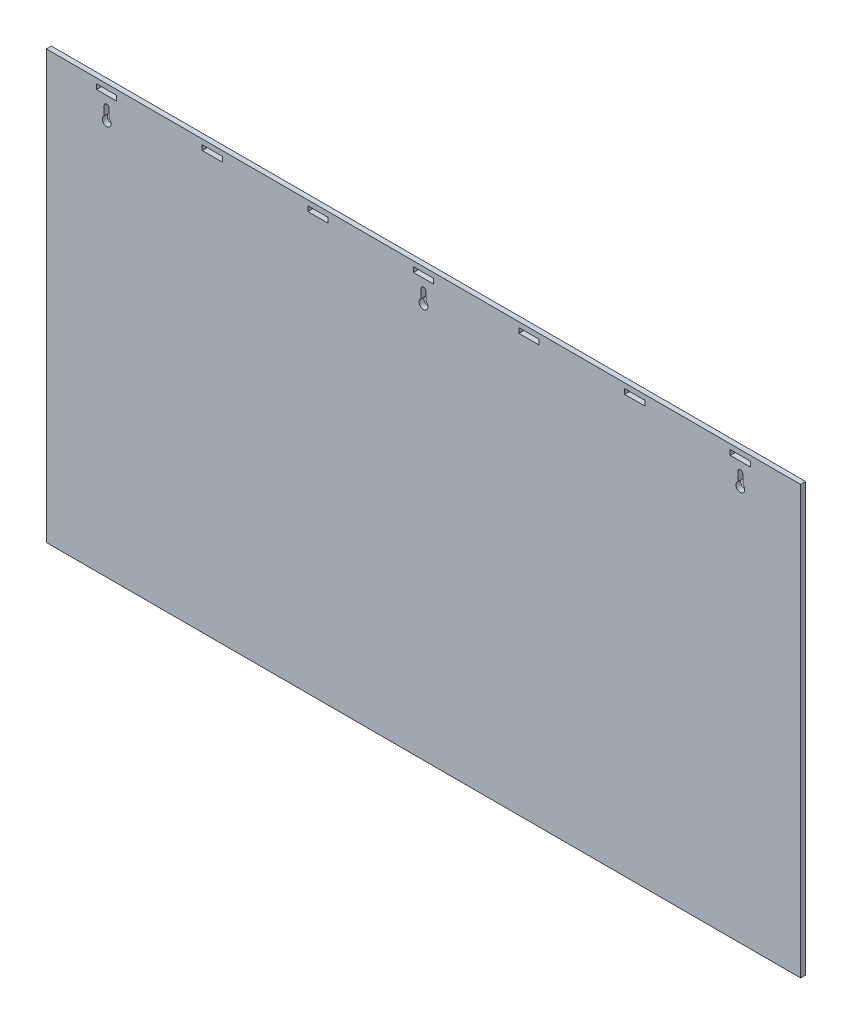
from build123d import *

# Parameters (mm, degrees)
SKETCH1_W           = 25.4
SKETCH1_H           = 6.35
BOSS_EXTRUDE1_DEPTH = 6.35


with BuildPart() as part:
    # Sketch1 → Boss-Extrude1 (new body)
    with BuildSketch(Plane.XY):
        Polygon((952.5, 539.75), (2.504e-06, 539.749997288), (2.504e-06, 533.399997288), (0, 0), (952.5, 0), align=None)
        with BuildLine():
            Line((73.025002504, 503.034743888), (73.025002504, 514.349997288))
            ThreePointArc((73.025002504, 514.349997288), (76.200002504, 517.524997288), (79.375002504, 514.349997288))
            Line((79.375002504, 514.349997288), (79.375002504, 503.034743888))
            ThreePointArc((79.375002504, 503.034743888), (76.200002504, 492.918747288), (73.025002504, 503.034743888))
        make_face(mode=Mode.SUBTRACT)
        with Locations((76.200002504, 530.224997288)):
            Rectangle(SKETCH1_W, SKETCH1_H, mode=Mode.SUBTRACT)
        with Locations((209.550002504, 530.224997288)):
            Rectangle(SKETCH1_W, SKETCH1_H, mode=Mode.SUBTRACT)
        with Locations((342.900002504, 530.224997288)):
            Rectangle(SKETCH1_W, SKETCH1_H, mode=Mode.SUBTRACT)
        with BuildLine():
            Line((473.075001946, 503.034777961), (473.075001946, 514.350031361))
            ThreePointArc((473.075001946, 514.350031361), (476.250001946, 517.525031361), (479.425001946, 514.350031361))
            Line((479.425001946, 514.350031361), (479.425001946, 503.034777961))
            ThreePointArc((479.425001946, 503.034777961), (476.250001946, 492.918781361), (473.075001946, 503.034777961))
        make_face(mode=Mode.SUBTRACT)
        with Locations((476.250002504, 530.224997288)):
            Rectangle(SKETCH1_W, SKETCH1_H, mode=Mode.SUBTRACT)
        with Locations((609.600002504, 530.224997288)):
            Rectangle(SKETCH1_W, SKETCH1_H, mode=Mode.SUBTRACT)
        with Locations((742.950002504, 530.224997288)):
            Rectangle(SKETCH1_W, SKETCH1_H, mode=Mode.SUBTRACT)
        with BuildLine():
            Line((873.124985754, 503.034617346), (873.124985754, 514.349870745))
            ThreePointArc((873.124985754, 514.349870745), (876.299985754, 517.524870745), (879.474985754, 514.349870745))
            Line((879.474985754, 514.349870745), (879.474985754, 503.034617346))
            ThreePointArc((879.474985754, 503.034617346), (876.299985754, 492.918620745), (873.124985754, 503.034617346))
        make_face(mode=Mode.SUBTRACT)
        with Locations((876.300002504, 530.224997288)):
            Rectangle(SKETCH1_W, SKETCH1_H, mode=Mode.SUBTRACT)
    extrude(amount=BOSS_EXTRUDE1_DEPTH)


solid = part.part
